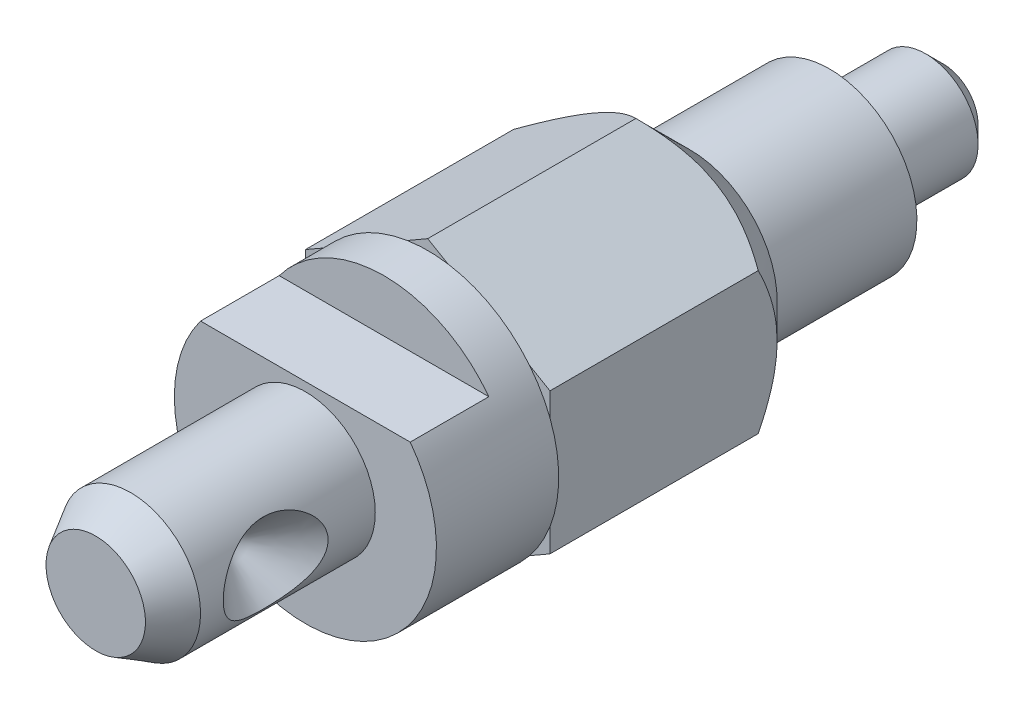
ISO-10303-21;
HEADER;
FILE_DESCRIPTION(('STEP AP214'),'2;1');
FILE_NAME('part.step','',(''),(''),'','','');
FILE_SCHEMA(('AUTOMOTIVE_DESIGN { 1 0 10303 214 1 1 1 1 }'));
ENDSEC;
DATA;
#1=APPLICATION_CONTEXT('core data for automotive mechanical design processes');
#2=APPLICATION_PROTOCOL_DEFINITION('international standard','automotive_design',2000,#1);
#3=PRODUCT_CONTEXT('',#1,'mechanical');
#4=PRODUCT('Part','Part','',(#3));
#5=PRODUCT_RELATED_PRODUCT_CATEGORY('part','',(#4));
#6=PRODUCT_DEFINITION_FORMATION('','',#4);
#7=PRODUCT_DEFINITION_CONTEXT('part definition',#1,'design');
#8=PRODUCT_DEFINITION('design','',#6,#7);
#9=PRODUCT_DEFINITION_SHAPE('','',#8);
#10=(LENGTH_UNIT() NAMED_UNIT(*) SI_UNIT(.MILLI.,.METRE.));
#11=(NAMED_UNIT(*) PLANE_ANGLE_UNIT() SI_UNIT($,.RADIAN.));
#12=(NAMED_UNIT(*) SI_UNIT($,.STERADIAN.) SOLID_ANGLE_UNIT());
#13=UNCERTAINTY_MEASURE_WITH_UNIT(LENGTH_MEASURE(1.E-05),#10,'distance_accuracy_value','');
#14=(GEOMETRIC_REPRESENTATION_CONTEXT(3) GLOBAL_UNCERTAINTY_ASSIGNED_CONTEXT((#13)) GLOBAL_UNIT_ASSIGNED_CONTEXT((#10,
#11,#12)) REPRESENTATION_CONTEXT('',''));
#15=CARTESIAN_POINT('',(0.,0.,0.));
#16=DIRECTION('',(0.,0.,1.));
#17=DIRECTION('',(1.,0.,0.));
#18=AXIS2_PLACEMENT_3D('',#15,#16,#17);
#19=CARTESIAN_POINT('',(0.,0.,42.));
#20=DIRECTION('',(0.,0.,-1.));
#21=DIRECTION('',(-1.,0.,0.));
#22=AXIS2_PLACEMENT_3D('',#19,#20,#21);
#23=PLANE('',#22);
#24=CARTESIAN_POINT('',(0.,0.,42.));
#25=DIRECTION('',(0.,0.,-1.));
#26=DIRECTION('',(-1.,0.,0.));
#27=AXIS2_PLACEMENT_3D('',#24,#25,#26);
#28=CIRCLE('',#27,2.84529946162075);
#29=CARTESIAN_POINT('',(-2.84529946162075,0.,42.));
#30=VERTEX_POINT('',#29);
#31=EDGE_CURVE('E324',#30,#30,#28,.F.);
#32=ORIENTED_EDGE('',*,*,#31,.T.);
#33=EDGE_LOOP('',(#32));
#34=FACE_BOUND('',#33,.T.);
#35=ADVANCED_FACE('F14',(#34),#23,.F.);
#36=CARTESIAN_POINT('',(0.999999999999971,0.,35.7));
#37=DIRECTION('',(1.,0.,0.));
#38=DIRECTION('',(0.,0.,-1.));
#39=AXIS2_PLACEMENT_3D('',#36,#37,#38);
#40=CONICAL_SURFACE('',#39,0.,0.785398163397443);
#41=CARTESIAN_POINT('',(3.51436275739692,-1.91030219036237,37.3348594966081));
#42=CARTESIAN_POINT('',(3.5561071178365,-1.8335136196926,37.4887949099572));
#43=CARTESIAN_POINT('',(3.60106331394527,-1.74489029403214,37.6360149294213));
#44=CARTESIAN_POINT('',(3.69207026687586,-1.54299697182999,37.9121244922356));
#45=CARTESIAN_POINT('',(3.73811880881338,-1.42977358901,38.0410479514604));
#46=CARTESIAN_POINT('',(3.80967651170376,-1.22220875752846,38.2321896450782));
#47=CARTESIAN_POINT('',(3.83670298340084,-1.13528525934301,38.3018998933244));
#48=CARTESIAN_POINT('',(3.8865014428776,-0.950886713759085,38.4275424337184));
#49=CARTESIAN_POINT('',(3.90928026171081,-0.853429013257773,38.483496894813));
#50=CARTESIAN_POINT('',(3.94509187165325,-0.666155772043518,38.5702517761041));
#51=CARTESIAN_POINT('',(3.95911502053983,-0.577759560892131,38.6036865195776));
#52=CARTESIAN_POINT('',(3.98138499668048,-0.396129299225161,38.6564398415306));
#53=CARTESIAN_POINT('',(3.98963574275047,-0.302898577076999,38.6757679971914));
#54=CARTESIAN_POINT('',(3.99950772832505,-0.113738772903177,38.6988661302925));
#55=CARTESIAN_POINT('',(4.00110049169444,-0.017799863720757,38.702569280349));
#56=CARTESIAN_POINT('',(3.99738984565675,0.173210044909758,38.6939075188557));
#57=CARTESIAN_POINT('',(3.9920859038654,0.268280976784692,38.6815413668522));
#58=CARTESIAN_POINT('',(3.97574780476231,0.448420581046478,38.6431033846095));
#59=CARTESIAN_POINT('',(3.96511435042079,0.533735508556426,38.6179885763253));
#60=CARTESIAN_POINT('',(3.93928956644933,0.699308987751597,38.5562288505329));
#61=CARTESIAN_POINT('',(3.92409640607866,0.779565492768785,38.5195793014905));
#62=CARTESIAN_POINT('',(3.88302448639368,0.96685655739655,38.4188316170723));
#63=CARTESIAN_POINT('',(3.85534818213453,1.07078346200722,38.3496869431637));
#64=CARTESIAN_POINT('',(3.79594567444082,1.26538916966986,38.1961288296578));
#65=CARTESIAN_POINT('',(3.76420999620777,1.35603587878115,38.1116794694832));
#66=CARTESIAN_POINT('',(3.68792748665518,1.55371609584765,37.8992745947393));
#67=CARTESIAN_POINT('',(3.64280030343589,1.65530122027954,37.7664635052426));
#68=CARTESIAN_POINT('',(3.55543603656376,1.83545709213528,37.4853240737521));
#69=CARTESIAN_POINT('',(3.5132017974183,1.91400543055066,37.3369808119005));
#70=CARTESIAN_POINT('',(3.43558984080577,2.05012091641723,37.0254924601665));
#71=CARTESIAN_POINT('',(3.40036396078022,2.1072431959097,36.8621129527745));
#72=CARTESIAN_POINT('',(3.35684110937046,2.17539024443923,36.6108871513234));
#73=CARTESIAN_POINT('',(3.3438854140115,2.1951841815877,36.5261112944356));
#74=CARTESIAN_POINT('',(3.32151551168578,2.22888978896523,36.3549475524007));
#75=CARTESIAN_POINT('',(3.31210004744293,2.24280354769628,36.2685602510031));
#76=CARTESIAN_POINT('',(3.29664304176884,2.26546838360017,36.0885370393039));
#77=CARTESIAN_POINT('',(3.29088791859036,2.27378367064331,35.9948213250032));
#78=CARTESIAN_POINT('',(3.28411640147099,2.28355307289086,35.8068580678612));
#79=CARTESIAN_POINT('',(3.28310020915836,2.28500689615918,35.7126105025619));
#80=CARTESIAN_POINT('',(3.28585787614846,2.28104059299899,35.524330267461));
#81=CARTESIAN_POINT('',(3.28963149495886,2.27562081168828,35.4302975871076));
#82=CARTESIAN_POINT('',(3.30178158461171,2.2579510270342,35.2432036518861));
#83=CARTESIAN_POINT('',(3.31015795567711,2.24570117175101,35.1501423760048));
#84=CARTESIAN_POINT('',(3.3407114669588,2.20022874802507,34.8818881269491));
#85=CARTESIAN_POINT('',(3.36851525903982,2.15806110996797,34.7087480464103));
#86=CARTESIAN_POINT('',(3.4356681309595,2.04944268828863,34.3723965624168));
#87=CARTESIAN_POINT('',(3.47503836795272,1.98294734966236,34.2092040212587));
#88=CARTESIAN_POINT('',(3.56265529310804,1.8211159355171,33.8881374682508));
#89=CARTESIAN_POINT('',(3.61127385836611,1.72438161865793,33.7310639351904));
#90=CARTESIAN_POINT('',(3.70908700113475,1.50243062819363,33.4388151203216));
#91=CARTESIAN_POINT('',(3.75827915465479,1.37730879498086,33.3035694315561));
#92=CARTESIAN_POINT('',(3.83033247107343,1.15581813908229,33.1143283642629));
#93=CARTESIAN_POINT('',(3.85564047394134,1.0691094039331,33.0499247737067));
#94=CARTESIAN_POINT('',(3.90178575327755,0.885970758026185,32.9347618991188));
#95=CARTESIAN_POINT('',(3.92263012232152,0.789556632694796,32.8839809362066));
#96=CARTESIAN_POINT('',(3.95514985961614,0.603576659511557,32.8057002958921));
#97=CARTESIAN_POINT('',(3.96773369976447,0.515169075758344,32.775845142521));
#98=CARTESIAN_POINT('',(3.98705476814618,0.334148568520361,32.7302456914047));
#99=CARTESIAN_POINT('',(3.99379552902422,0.241538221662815,32.7144928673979));
#100=CARTESIAN_POINT('',(4.0007284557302,0.0544116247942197,32.6982931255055));
#101=CARTESIAN_POINT('',(4.00089901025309,-0.0401098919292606,32.6978967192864));
#102=CARTESIAN_POINT('',(3.99461662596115,-0.227714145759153,32.7125725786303));
#103=CARTESIAN_POINT('',(3.98816242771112,-0.320796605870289,32.7276477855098));
#104=CARTESIAN_POINT('',(3.96978699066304,-0.49838519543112,32.7709861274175));
#105=CARTESIAN_POINT('',(3.95814514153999,-0.583088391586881,32.7985764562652));
#106=CARTESIAN_POINT('',(3.93048356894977,-0.747151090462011,32.8650125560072));
#107=CARTESIAN_POINT('',(3.91446203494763,-0.826508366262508,32.903862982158));
#108=CARTESIAN_POINT('',(3.87105954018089,-1.0138531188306,33.0109870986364));
#109=CARTESIAN_POINT('',(3.84183228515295,-1.11836586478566,33.0845954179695));
#110=CARTESIAN_POINT('',(3.77960819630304,-1.31343290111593,33.2471752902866));
#111=CARTESIAN_POINT('',(3.74660220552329,-1.40395197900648,33.3361844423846));
#112=CARTESIAN_POINT('',(3.66808686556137,-1.59993691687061,33.5585674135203));
#113=CARTESIAN_POINT('',(3.62217607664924,-1.69986103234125,33.6966797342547));
#114=CARTESIAN_POINT('',(3.53418598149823,-1.87595804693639,33.9882714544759));
#115=CARTESIAN_POINT('',(3.49210989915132,-1.95211108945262,34.1417635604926));
#116=CARTESIAN_POINT('',(3.41606220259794,-2.08238524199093,34.4630624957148));
#117=CARTESIAN_POINT('',(3.38224182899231,-2.13610643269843,34.6310695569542));
#118=CARTESIAN_POINT('',(3.34173076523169,-2.1985052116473,34.8888660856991));
#119=CARTESIAN_POINT('',(3.32992976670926,-2.21627502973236,34.9757701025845));
#120=CARTESIAN_POINT('',(3.31015224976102,-2.24571004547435,35.1510251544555));
#121=CARTESIAN_POINT('',(3.30217429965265,-2.25737752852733,35.2393756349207));
#122=CARTESIAN_POINT('',(3.29008633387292,-2.27496182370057,35.4211814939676));
#123=CARTESIAN_POINT('',(3.28617875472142,-2.2805781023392,35.514679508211));
#124=CARTESIAN_POINT('',(3.28309570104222,-2.28501420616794,35.7019194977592));
#125=CARTESIAN_POINT('',(3.28392047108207,-2.28383368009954,35.7956614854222));
#126=CARTESIAN_POINT('',(3.29026632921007,-2.27468229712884,35.9826465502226));
#127=CARTESIAN_POINT('',(3.29578693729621,-2.26671213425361,36.0758896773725));
#128=CARTESIAN_POINT('',(3.31126432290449,-2.24403876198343,36.2611522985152));
#129=CARTESIAN_POINT('',(3.32122074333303,-2.22933609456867,36.3531718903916));
#130=CARTESIAN_POINT('',(3.3536426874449,-2.18047848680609,36.5999234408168));
#131=CARTESIAN_POINT('',(3.37997406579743,-2.13992107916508,36.7529383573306));
#132=CARTESIAN_POINT('',(3.44144194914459,-2.03958648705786,37.0507606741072));
#133=CARTESIAN_POINT('',(3.47658728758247,-1.979790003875,37.1955596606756));
#134=CARTESIAN_POINT('',(3.51436275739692,-1.91030219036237,37.3348594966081));
#135=B_SPLINE_CURVE_WITH_KNOTS('',3,(#41,#42,#43,#44,#45,#46,#47,#48,#49,#50,#51,#52,#53,#54,
#55,#56,#57,#58,#59,#60,#61,#62,#63,#64,#65,#66,#67,#68,#69,#70,#71,#72,#73,#74,#75,#76,#77,#78,
#79,#80,#81,#82,#83,#84,#85,#86,#87,#88,#89,#90,#91,#92,#93,#94,#95,#96,#97,#98,#99,#100,#101,
#102,#103,#104,#105,#106,#107,#108,#109,#110,#111,#112,#113,#114,#115,#116,#117,#118,#119,#120,
#121,#122,#123,#124,#125,#126,#127,#128,#129,#130,#131,#132,#133,#134),.UNSPECIFIED.,.T.,.F.,(4,
2,2,2,2,2,2,2,2,2,2,2,2,2,2,2,2,2,2,2,2,2,2,2,2,2,2,2,2,2,2,2,2,2,2,2,2,2,2,2,2,2,2,2,2,2,4),
(0.,0.530571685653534,1.06014664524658,1.40300195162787,1.74530103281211,2.0307454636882,
2.31599592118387,2.60246515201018,2.88895649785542,3.15656593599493,3.42428296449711,
3.80572800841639,4.18808019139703,4.70489972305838,5.22222033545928,5.74975482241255,
6.01356911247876,6.27728962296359,6.55970104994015,6.84212449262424,7.12453375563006,
7.4069368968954,7.94544572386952,8.48494578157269,9.05444851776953,9.62207590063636,
9.95380959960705,10.2850122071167,10.5662923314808,10.8474022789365,11.1294367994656,
11.4115249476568,11.6799755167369,11.9485372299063,12.3397401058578,12.7319118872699,
13.2587566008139,13.786040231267,14.3223597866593,14.5905644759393,14.8586686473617,
15.1395488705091,15.4204436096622,15.7013096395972,15.9821530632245,16.4617974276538,
16.9419244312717),.UNSPECIFIED.);
#136=CARTESIAN_POINT('',(3.51436275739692,-1.91030219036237,37.3348594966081));
#137=VERTEX_POINT('',#136);
#138=EDGE_CURVE('E334',#137,#137,#135,.T.);
#139=ORIENTED_EDGE('',*,*,#138,.F.);
#140=EDGE_LOOP('',(#139));
#141=FACE_BOUND('',#140,.T.);
#142=CARTESIAN_POINT('',(0.999999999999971,0.,35.7));
#143=VERTEX_POINT('',#142);
#144=VERTEX_LOOP('',#143);
#145=FACE_BOUND('',#144,.T.);
#146=ADVANCED_FACE('F118',(#141,#145),#40,.F.);
#147=CARTESIAN_POINT('',(0.,0.,42.));
#148=DIRECTION('',(0.,0.,-1.));
#149=DIRECTION('',(-1.,0.,0.));
#150=AXIS2_PLACEMENT_3D('',#147,#148,#149);
#151=CONICAL_SURFACE('',#150,2.84529946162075,0.523598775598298);
#152=CARTESIAN_POINT('',(0.,0.,40.));
#153=DIRECTION('',(0.,0.,-1.));
#154=DIRECTION('',(-1.,0.,0.));
#155=AXIS2_PLACEMENT_3D('',#152,#153,#154);
#156=CIRCLE('',#155,4.);
#157=CARTESIAN_POINT('',(-4.,0.,40.));
#158=VERTEX_POINT('',#157);
#159=EDGE_CURVE('E328',#158,#158,#156,.T.);
#160=ORIENTED_EDGE('',*,*,#159,.F.);
#161=EDGE_LOOP('',(#160));
#162=FACE_BOUND('',#161,.T.);
#163=ORIENTED_EDGE('',*,*,#31,.F.);
#164=EDGE_LOOP('',(#163));
#165=FACE_BOUND('',#164,.T.);
#166=ADVANCED_FACE('F120',(#162,#165),#151,.T.);
#167=CARTESIAN_POINT('',(0.,0.,30.));
#168=DIRECTION('',(0.,0.,1.));
#169=DIRECTION('',(1.,0.,0.));
#170=AXIS2_PLACEMENT_3D('',#167,#168,#169);
#171=CYLINDRICAL_SURFACE('',#170,4.);
#172=ORIENTED_EDGE('',*,*,#159,.T.);
#173=EDGE_LOOP('',(#172));
#174=FACE_BOUND('',#173,.T.);
#175=CARTESIAN_POINT('',(0.,0.,30.));
#176=DIRECTION('',(0.,0.,1.));
#177=DIRECTION('',(1.,0.,0.));
#178=AXIS2_PLACEMENT_3D('',#175,#176,#177);
#179=CIRCLE('',#178,4.);
#180=CARTESIAN_POINT('',(4.,0.,30.));
#181=VERTEX_POINT('',#180);
#182=EDGE_CURVE('E303',#181,#181,#179,.T.);
#183=ORIENTED_EDGE('',*,*,#182,.T.);
#184=EDGE_LOOP('',(#183));
#185=FACE_BOUND('',#184,.T.);
#186=ORIENTED_EDGE('',*,*,#138,.T.);
#187=EDGE_LOOP('',(#186));
#188=FACE_BOUND('',#187,.T.);
#189=ADVANCED_FACE('F130',(#174,#185,#188),#171,.T.);
#190=CARTESIAN_POINT('',(0.,0.,30.));
#191=DIRECTION('',(0.,0.,1.));
#192=DIRECTION('',(1.,0.,0.));
#193=AXIS2_PLACEMENT_3D('',#190,#191,#192);
#194=PLANE('',#193);
#195=DIRECTION('',(1.,0.,0.));
#196=VECTOR('',#195,1.);
#197=CARTESIAN_POINT('',(0.,4.5,30.));
#198=LINE('',#197,#196);
#199=CARTESIAN_POINT('',(-6.,4.5,30.));
#200=VERTEX_POINT('',#199);
#201=CARTESIAN_POINT('',(6.,4.5,30.));
#202=VERTEX_POINT('',#201);
#203=EDGE_CURVE('E325',#200,#202,#198,.T.);
#204=ORIENTED_EDGE('',*,*,#203,.F.);
#205=CARTESIAN_POINT('',(0.,0.,30.));
#206=DIRECTION('',(0.,0.,1.));
#207=DIRECTION('',(1.,0.,0.));
#208=AXIS2_PLACEMENT_3D('',#205,#206,#207);
#209=CIRCLE('',#208,7.5);
#210=EDGE_CURVE('E296',#200,#202,#209,.T.);
#211=ORIENTED_EDGE('',*,*,#210,.T.);
#212=EDGE_LOOP('',(#204,#211));
#213=FACE_BOUND('',#212,.T.);
#214=ORIENTED_EDGE('',*,*,#182,.F.);
#215=EDGE_LOOP('',(#214));
#216=FACE_BOUND('',#215,.T.);
#217=ADVANCED_FACE('F136',(#213,#216),#194,.T.);
#218=CARTESIAN_POINT('',(19.5,4.5,25.5));
#219=DIRECTION('',(0.,-1.,0.));
#220=DIRECTION('',(0.,0.,1.));
#221=AXIS2_PLACEMENT_3D('',#218,#219,#220);
#222=PLANE('',#221);
#223=DIRECTION('',(-1.,0.,0.));
#224=VECTOR('',#223,1.);
#225=CARTESIAN_POINT('',(19.5,4.5,25.5));
#226=LINE('',#225,#224);
#227=CARTESIAN_POINT('',(6.,4.5,25.5));
#228=VERTEX_POINT('',#227);
#229=CARTESIAN_POINT('',(-6.,4.5,25.5));
#230=VERTEX_POINT('',#229);
#231=EDGE_CURVE('E316',#228,#230,#226,.T.);
#232=ORIENTED_EDGE('',*,*,#231,.T.);
#233=DIRECTION('',(0.,0.,1.));
#234=VECTOR('',#233,1.);
#235=CARTESIAN_POINT('',(-6.,4.5,23.));
#236=LINE('',#235,#234);
#237=EDGE_CURVE('E313',#200,#230,#236,.F.);
#238=ORIENTED_EDGE('',*,*,#237,.F.);
#239=ORIENTED_EDGE('',*,*,#203,.T.);
#240=DIRECTION('',(0.,0.,1.));
#241=VECTOR('',#240,1.);
#242=CARTESIAN_POINT('',(6.,4.5,23.));
#243=LINE('',#242,#241);
#244=EDGE_CURVE('E308',#228,#202,#243,.T.);
#245=ORIENTED_EDGE('',*,*,#244,.F.);
#246=EDGE_LOOP('',(#232,#238,#239,#245));
#247=FACE_BOUND('',#246,.T.);
#248=ADVANCED_FACE('F133',(#247),#222,.F.);
#249=CARTESIAN_POINT('',(19.5,9.49790295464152,25.5));
#250=DIRECTION('',(0.,0.,-1.));
#251=DIRECTION('',(0.,-1.,0.));
#252=AXIS2_PLACEMENT_3D('',#249,#250,#251);
#253=PLANE('',#252);
#254=ORIENTED_EDGE('',*,*,#231,.F.);
#255=CARTESIAN_POINT('',(0.,0.,25.5));
#256=DIRECTION('',(0.,0.,-1.));
#257=DIRECTION('',(0.,-1.,0.));
#258=AXIS2_PLACEMENT_3D('',#255,#256,#257);
#259=CIRCLE('',#258,7.5);
#260=EDGE_CURVE('E323',#230,#228,#259,.T.);
#261=ORIENTED_EDGE('',*,*,#260,.F.);
#262=EDGE_LOOP('',(#254,#261));
#263=FACE_BOUND('',#262,.T.);
#264=ADVANCED_FACE('F137',(#263),#253,.F.);
#265=CARTESIAN_POINT('',(0.,0.,23.));
#266=DIRECTION('',(0.,0.,-1.));
#267=DIRECTION('',(-1.,0.,0.));
#268=AXIS2_PLACEMENT_3D('',#265,#266,#267);
#269=PLANE('',#268);
#270=DIRECTION('',(-0.866025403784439,-0.5,0.));
#271=VECTOR('',#270,1.);
#272=CARTESIAN_POINT('',(0.,8.08290376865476,23.));
#273=LINE('',#272,#271);
#274=CARTESIAN_POINT('',(-1.1681552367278,7.4084690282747,23.));
#275=VERTEX_POINT('',#274);
#276=CARTESIAN_POINT('',(-5.83184476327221,4.71588662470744,23.));
#277=VERTEX_POINT('',#276);
#278=EDGE_CURVE('E384',#275,#277,#273,.T.);
#279=ORIENTED_EDGE('',*,*,#278,.T.);
#280=CARTESIAN_POINT('',(0.,0.,23.));
#281=DIRECTION('',(0.,0.,-1.));
#282=DIRECTION('',(-1.,0.,0.));
#283=AXIS2_PLACEMENT_3D('',#280,#281,#282);
#284=CIRCLE('',#283,7.5);
#285=EDGE_CURVE('E330',#277,#275,#284,.T.);
#286=ORIENTED_EDGE('',*,*,#285,.T.);
#287=EDGE_LOOP('',(#279,#286));
#288=FACE_BOUND('',#287,.T.);
#289=ADVANCED_FACE('F557',(#288),#269,.T.);
#290=DIRECTION('',(-0.866025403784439,0.5,0.));
#291=VECTOR('',#290,1.);
#292=CARTESIAN_POINT('',(7.,4.04145188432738,23.));
#293=LINE('',#292,#291);
#294=CARTESIAN_POINT('',(5.8318447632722,4.71588662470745,23.));
#295=VERTEX_POINT('',#294);
#296=CARTESIAN_POINT('',(1.16815523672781,7.40846902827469,23.));
#297=VERTEX_POINT('',#296);
#298=EDGE_CURVE('E388',#295,#297,#293,.T.);
#299=ORIENTED_EDGE('',*,*,#298,.T.);
#300=EDGE_CURVE('E416',#297,#295,#284,.T.);
#301=ORIENTED_EDGE('',*,*,#300,.T.);
#302=EDGE_LOOP('',(#299,#301));
#303=FACE_BOUND('',#302,.T.);
#304=ADVANCED_FACE('F359',(#303),#269,.T.);
#305=DIRECTION('',(0.,1.,0.));
#306=VECTOR('',#305,1.);
#307=CARTESIAN_POINT('',(7.,-4.04145188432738,23.));
#308=LINE('',#307,#306);
#309=CARTESIAN_POINT('',(7.,-2.69258240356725,23.));
#310=VERTEX_POINT('',#309);
#311=CARTESIAN_POINT('',(7.,2.69258240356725,23.));
#312=VERTEX_POINT('',#311);
#313=EDGE_CURVE('E396',#310,#312,#308,.T.);
#314=ORIENTED_EDGE('',*,*,#313,.T.);
#315=EDGE_CURVE('E369',#312,#310,#284,.T.);
#316=ORIENTED_EDGE('',*,*,#315,.T.);
#317=EDGE_LOOP('',(#314,#316));
#318=FACE_BOUND('',#317,.T.);
#319=ADVANCED_FACE('F346',(#318),#269,.T.);
#320=DIRECTION('',(0.866025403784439,0.5,0.));
#321=VECTOR('',#320,1.);
#322=CARTESIAN_POINT('',(0.,-8.08290376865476,23.));
#323=LINE('',#322,#321);
#324=CARTESIAN_POINT('',(1.16815523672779,-7.4084690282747,23.));
#325=VERTEX_POINT('',#324);
#326=CARTESIAN_POINT('',(5.83184476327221,-4.71588662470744,23.));
#327=VERTEX_POINT('',#326);
#328=EDGE_CURVE('E36',#325,#327,#323,.T.);
#329=ORIENTED_EDGE('',*,*,#328,.T.);
#330=EDGE_CURVE('E301',#327,#325,#284,.T.);
#331=ORIENTED_EDGE('',*,*,#330,.T.);
#332=EDGE_LOOP('',(#329,#331));
#333=FACE_BOUND('',#332,.T.);
#334=ADVANCED_FACE('F166',(#333),#269,.T.);
#335=DIRECTION('',(0.866025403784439,-0.5,0.));
#336=VECTOR('',#335,1.);
#337=CARTESIAN_POINT('',(-7.,-4.04145188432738,23.));
#338=LINE('',#337,#336);
#339=CARTESIAN_POINT('',(-5.8318447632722,-4.71588662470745,23.));
#340=VERTEX_POINT('',#339);
#341=CARTESIAN_POINT('',(-1.1681552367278,-7.40846902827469,23.));
#342=VERTEX_POINT('',#341);
#343=EDGE_CURVE('E372',#340,#342,#338,.T.);
#344=ORIENTED_EDGE('',*,*,#343,.T.);
#345=EDGE_CURVE('E295',#342,#340,#284,.T.);
#346=ORIENTED_EDGE('',*,*,#345,.T.);
#347=EDGE_LOOP('',(#344,#346));
#348=FACE_BOUND('',#347,.T.);
#349=ADVANCED_FACE('F350',(#348),#269,.T.);
#350=DIRECTION('',(0.,-1.,0.));
#351=VECTOR('',#350,1.);
#352=CARTESIAN_POINT('',(-7.,4.04145188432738,23.));
#353=LINE('',#352,#351);
#354=CARTESIAN_POINT('',(-7.,2.69258240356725,23.));
#355=VERTEX_POINT('',#354);
#356=CARTESIAN_POINT('',(-7.,-2.69258240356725,23.));
#357=VERTEX_POINT('',#356);
#358=EDGE_CURVE('E378',#355,#357,#353,.T.);
#359=ORIENTED_EDGE('',*,*,#358,.T.);
#360=EDGE_CURVE('E287',#357,#355,#284,.T.);
#361=ORIENTED_EDGE('',*,*,#360,.T.);
#362=EDGE_LOOP('',(#359,#361));
#363=FACE_BOUND('',#362,.T.);
#364=ADVANCED_FACE('F357',(#363),#269,.T.);
#365=CARTESIAN_POINT('',(0.,0.,23.));
#366=DIRECTION('',(0.,0.,1.));
#367=DIRECTION('',(1.,0.,0.));
#368=AXIS2_PLACEMENT_3D('',#365,#366,#367);
#369=CYLINDRICAL_SURFACE('',#368,7.5);
#370=EDGE_CURVE('E291',#355,#277,#284,.T.);
#371=ORIENTED_EDGE('',*,*,#370,.F.);
#372=ORIENTED_EDGE('',*,*,#360,.F.);
#373=EDGE_CURVE('E284',#340,#357,#284,.T.);
#374=ORIENTED_EDGE('',*,*,#373,.F.);
#375=ORIENTED_EDGE('',*,*,#345,.F.);
#376=EDGE_CURVE('E285',#325,#342,#284,.T.);
#377=ORIENTED_EDGE('',*,*,#376,.F.);
#378=ORIENTED_EDGE('',*,*,#330,.F.);
#379=EDGE_CURVE('E29',#310,#327,#284,.T.);
#380=ORIENTED_EDGE('',*,*,#379,.F.);
#381=ORIENTED_EDGE('',*,*,#315,.F.);
#382=EDGE_CURVE('E401',#295,#312,#284,.T.);
#383=ORIENTED_EDGE('',*,*,#382,.F.);
#384=ORIENTED_EDGE('',*,*,#300,.F.);
#385=EDGE_CURVE('E410',#275,#297,#284,.T.);
#386=ORIENTED_EDGE('',*,*,#385,.F.);
#387=ORIENTED_EDGE('',*,*,#285,.F.);
#388=EDGE_LOOP('',(#371,#372,#374,#375,#377,#378,#380,#381,#383,#384,#386,#387));
#389=FACE_BOUND('',#388,.T.);
#390=ORIENTED_EDGE('',*,*,#260,.T.);
#391=ORIENTED_EDGE('',*,*,#244,.T.);
#392=ORIENTED_EDGE('',*,*,#210,.F.);
#393=ORIENTED_EDGE('',*,*,#237,.T.);
#394=EDGE_LOOP('',(#390,#391,#392,#393));
#395=FACE_BOUND('',#394,.T.);
#396=ADVANCED_FACE('F164',(#389,#395),#369,.T.);
#397=CARTESIAN_POINT('',(0.,0.,0.));
#398=DIRECTION('',(0.,0.,1.));
#399=DIRECTION('',(0.5,-0.866025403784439,0.));
#400=AXIS2_PLACEMENT_3D('',#397,#398,#399);
#401=PLANE('',#400);
#402=CARTESIAN_POINT('',(0.,0.,0.));
#403=DIRECTION('',(0.,0.,1.));
#404=DIRECTION('',(1.,0.,0.));
#405=AXIS2_PLACEMENT_3D('',#402,#403,#404);
#406=CIRCLE('',#405,3.);
#407=CARTESIAN_POINT('',(3.,0.,0.));
#408=VERTEX_POINT('',#407);
#409=EDGE_CURVE('E419',#408,#408,#406,.F.);
#410=ORIENTED_EDGE('',*,*,#409,.F.);
#411=EDGE_LOOP('',(#410));
#412=FACE_BOUND('',#411,.T.);
#413=CARTESIAN_POINT('',(0.,0.,0.));
#414=DIRECTION('',(0.,0.,1.));
#415=DIRECTION('',(0.5,-0.866025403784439,0.));
#416=AXIS2_PLACEMENT_3D('',#413,#414,#415);
#417=CIRCLE('',#416,5.);
#418=CARTESIAN_POINT('',(2.5,-4.3301270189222,0.));
#419=VERTEX_POINT('',#418);
#420=EDGE_CURVE('E281',#419,#419,#417,.T.);
#421=ORIENTED_EDGE('',*,*,#420,.F.);
#422=EDGE_LOOP('',(#421));
#423=FACE_BOUND('',#422,.T.);
#424=ADVANCED_FACE('F160',(#412,#423),#401,.F.);
#425=CARTESIAN_POINT('',(0.,0.,10.));
#426=DIRECTION('',(0.,0.,-1.));
#427=DIRECTION('',(-0.5,0.866025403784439,0.));
#428=AXIS2_PLACEMENT_3D('',#425,#426,#427);
#429=CYLINDRICAL_SURFACE('',#428,5.);
#430=ORIENTED_EDGE('',*,*,#420,.T.);
#431=EDGE_LOOP('',(#430));
#432=FACE_BOUND('',#431,.T.);
#433=CARTESIAN_POINT('',(0.,0.,8.));
#434=DIRECTION('',(0.,0.,-1.));
#435=DIRECTION('',(-0.5,0.866025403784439,0.));
#436=AXIS2_PLACEMENT_3D('',#433,#434,#435);
#437=CIRCLE('',#436,5.);
#438=CARTESIAN_POINT('',(-2.5,4.3301270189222,8.));
#439=VERTEX_POINT('',#438);
#440=EDGE_CURVE('E340',#439,#439,#437,.T.);
#441=ORIENTED_EDGE('',*,*,#440,.T.);
#442=EDGE_LOOP('',(#441));
#443=FACE_BOUND('',#442,.T.);
#444=ADVANCED_FACE('F156',(#432,#443),#429,.T.);
#445=CARTESIAN_POINT('',(0.,0.,11.0829037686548));
#446=DIRECTION('',(0.,0.,1.));
#447=DIRECTION('',(0.5,-0.866025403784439,0.));
#448=AXIS2_PLACEMENT_3D('',#445,#446,#447);
#449=CONICAL_SURFACE('',#448,8.08290376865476,0.785398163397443);
#450=ORIENTED_EDGE('',*,*,#440,.F.);
#451=EDGE_LOOP('',(#450));
#452=FACE_BOUND('',#451,.T.);
#453=CARTESIAN_POINT('',(-3.12318920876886,-9.88607789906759,13.3676828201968));
#454=CARTESIAN_POINT('',(-2.96021190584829,-9.7919829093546,13.2288949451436));
#455=CARTESIAN_POINT('',(-2.79628352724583,-9.69733881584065,13.091571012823));
#456=CARTESIAN_POINT('',(-2.46616540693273,-9.50674503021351,12.8204907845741));
#457=CARTESIAN_POINT('',(-2.29997506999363,-9.41079499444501,12.686735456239));
#458=CARTESIAN_POINT('',(-1.96376274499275,-9.21668271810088,12.4224870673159));
#459=CARTESIAN_POINT('',(-1.79372104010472,-9.11850909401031,12.2920273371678));
#460=CARTESIAN_POINT('',(-1.45069580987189,-8.92046338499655,12.0363869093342));
#461=CARTESIAN_POINT('',(-1.27771250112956,-8.82059142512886,11.9112058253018));
#462=CARTESIAN_POINT('',(-0.919567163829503,-8.61381611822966,11.6611172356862));
#463=CARTESIAN_POINT('',(-0.734230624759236,-8.50681201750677,11.536541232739));
#464=CARTESIAN_POINT('',(-0.359277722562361,-8.29033285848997,11.296160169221));
#465=CARTESIAN_POINT('',(-0.169660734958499,-8.18085743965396,11.1803563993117));
#466=CARTESIAN_POINT('',(0.213756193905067,-7.95949157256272,10.9600528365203));
#467=CARTESIAN_POINT('',(0.407541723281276,-7.84760944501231,10.8555198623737));
#468=CARTESIAN_POINT('',(0.800161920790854,-7.62093006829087,10.6600936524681));
#469=CARTESIAN_POINT('',(0.998994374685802,-7.50613409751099,10.5691945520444));
#470=CARTESIAN_POINT('',(1.3902833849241,-7.28022328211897,10.4089512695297));
#471=CARTESIAN_POINT('',(1.58244825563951,-7.16927684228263,10.3386676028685));
#472=CARTESIAN_POINT('',(1.97109122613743,-6.944893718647,10.2159692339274));
#473=CARTESIAN_POINT('',(2.16756965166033,-6.8314568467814,10.1635558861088));
#474=CARTESIAN_POINT('',(2.56056321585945,-6.60456190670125,10.0801032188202));
#475=CARTESIAN_POINT('',(2.75702297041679,-6.49113581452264,10.0487216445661));
#476=CARTESIAN_POINT('',(3.15165186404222,-6.263296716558,10.0078777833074));
#477=CARTESIAN_POINT('',(3.34982076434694,-6.14888384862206,9.99841248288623));
#478=CARTESIAN_POINT('',(3.74026236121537,-5.92346228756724,10.0019724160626));
#479=CARTESIAN_POINT('',(3.93253975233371,-5.81245088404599,10.0143548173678));
#480=CARTESIAN_POINT('',(4.31526794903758,-5.59148265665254,10.059593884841));
#481=CARTESIAN_POINT('',(4.50571856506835,-5.48152594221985,10.0924526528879));
#482=CARTESIAN_POINT('',(4.88663127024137,-5.26160588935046,10.1774843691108));
#483=CARTESIAN_POINT('',(5.07703978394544,-5.15167348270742,10.2299725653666));
#484=CARTESIAN_POINT('',(5.45374514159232,-4.93418254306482,10.3515884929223));
#485=CARTESIAN_POINT('',(5.64004244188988,-4.82662374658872,10.4207143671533));
#486=CARTESIAN_POINT('',(6.03414803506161,-4.59908677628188,10.5836168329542));
#487=CARTESIAN_POINT('',(6.2412999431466,-4.47948756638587,10.6794924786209));
#488=CARTESIAN_POINT('',(6.65013734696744,-4.24344518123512,10.8858122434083));
#489=CARTESIAN_POINT('',(6.85182012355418,-4.12700357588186,10.9962634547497));
#490=CARTESIAN_POINT('',(7.25075556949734,-3.89667808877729,11.2290904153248));
#491=CARTESIAN_POINT('',(7.44799130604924,-3.78280398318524,11.3515045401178));
#492=CARTESIAN_POINT('',(7.83789367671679,-3.55769374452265,11.6055349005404));
#493=CARTESIAN_POINT('',(8.03056106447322,-3.44645717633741,11.7371496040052));
#494=CARTESIAN_POINT('',(8.40231847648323,-3.2318229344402,12.0009133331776));
#495=CARTESIAN_POINT('',(8.58160266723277,-3.12831315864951,12.1326993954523));
#496=CARTESIAN_POINT('',(8.93709823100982,-2.92306769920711,12.4017035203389));
#497=CARTESIAN_POINT('',(9.11330936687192,-2.82133215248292,12.5389219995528));
#498=CARTESIAN_POINT('',(9.46161600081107,-2.62023722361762,12.816659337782));
#499=CARTESIAN_POINT('',(9.6337334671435,-2.52086515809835,12.9571415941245));
#500=CARTESIAN_POINT('',(9.97563178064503,-2.32347007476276,13.2417392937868));
#501=CARTESIAN_POINT('',(10.1454132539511,-2.22544669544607,13.3858537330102));
#502=CARTESIAN_POINT('',(10.3142192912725,-2.12798648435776,13.5314503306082));
#503=B_SPLINE_CURVE_WITH_KNOTS('',3,(#453,#454,#455,#456,#457,#458,#459,#460,#461,#462,#463,
#464,#465,#466,#467,#468,#469,#470,#471,#472,#473,#474,#475,#476,#477,#478,#479,#480,#481,#482,
#483,#484,#485,#486,#487,#488,#489,#490,#491,#492,#493,#494,#495,#496,#497,#498,#499,#500,#501,
#502),.UNSPECIFIED.,.F.,.F.,(4,2,2,2,2,2,2,2,2,2,2,2,2,2,2,2,2,2,2,2,2,2,2,2,4),(0.,
0.701511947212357,1.40321220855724,2.1103525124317,2.81744097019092,3.56015211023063,
4.30297231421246,5.04354223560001,5.7837926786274,6.48143790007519,7.17913598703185,
7.8651851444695,8.55113996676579,9.21724689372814,9.88342220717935,10.5607908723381,
11.2380839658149,12.0105614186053,12.783416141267,13.5588369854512,14.3341290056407,
15.0702502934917,15.8064281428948,16.5365278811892,17.26642795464),.UNSPECIFIED.);
#504=CARTESIAN_POINT('',(0.,-8.08290376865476,11.0829037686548));
#505=VERTEX_POINT('',#504);
#506=CARTESIAN_POINT('',(7.,-4.04145188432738,11.0829037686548));
#507=VERTEX_POINT('',#506);
#508=EDGE_CURVE('E203',#505,#507,#503,.T.);
#509=ORIENTED_EDGE('',*,*,#508,.F.);
#510=CARTESIAN_POINT('',(-7.0002,-4.04133641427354,11.083019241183));
#511=CARTESIAN_POINT('',(-6.87984053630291,-4.11082598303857,11.0135371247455));
#512=CARTESIAN_POINT('',(-6.75855593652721,-4.18084967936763,10.9461873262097));
#513=CARTESIAN_POINT('',(-6.51395497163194,-4.32207011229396,10.816401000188));
#514=CARTESIAN_POINT('',(-6.3906375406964,-4.39326746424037,10.7539671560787));
#515=CARTESIAN_POINT('',(-6.01621815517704,-4.60943859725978,10.5744801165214));
#516=CARTESIAN_POINT('',(-5.76194658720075,-4.75624235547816,10.4660070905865));
#517=CARTESIAN_POINT('',(-5.24918766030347,-5.05228385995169,10.2802545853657));
#518=CARTESIAN_POINT('',(-4.99083135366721,-5.20144594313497,10.2025071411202));
#519=CARTESIAN_POINT('',(-4.59904950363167,-5.4276412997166,10.1125725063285));
#520=CARTESIAN_POINT('',(-4.46787875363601,-5.5033727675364,10.0870540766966));
#521=CARTESIAN_POINT('',(-4.20442664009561,-5.65547691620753,10.0454901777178));
#522=CARTESIAN_POINT('',(-4.07214544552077,-5.73184949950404,10.0294432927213));
#523=CARTESIAN_POINT('',(-3.74979301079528,-5.91795976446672,10.0025383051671));
#524=CARTESIAN_POINT('',(-3.55937444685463,-6.02789797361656,9.99689322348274));
#525=CARTESIAN_POINT('',(-3.17888053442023,-6.24757623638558,10.0063687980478));
#526=CARTESIAN_POINT('',(-2.9888053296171,-6.35731620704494,10.0214967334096));
#527=CARTESIAN_POINT('',(-2.61044693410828,-6.57576152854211,10.0716266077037));
#528=CARTESIAN_POINT('',(-2.42216598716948,-6.68446558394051,10.1066507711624));
#529=CARTESIAN_POINT('',(-2.04884018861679,-6.90000533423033,10.1946689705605));
#530=CARTESIAN_POINT('',(-1.86379509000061,-7.00684117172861,10.2476616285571));
#531=CARTESIAN_POINT('',(-1.53530966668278,-7.19649231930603,10.3566828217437));
#532=CARTESIAN_POINT('',(-1.39114192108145,-7.27972760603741,10.4098439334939));
#533=CARTESIAN_POINT('',(-1.10539436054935,-7.4447040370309,10.5247327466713));
#534=CARTESIAN_POINT('',(-0.963814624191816,-7.52644513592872,10.5864607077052));
#535=CARTESIAN_POINT('',(-0.683689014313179,-7.68817573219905,10.7170995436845));
#536=CARTESIAN_POINT('',(-0.545135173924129,-7.76816982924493,10.785987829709));
#537=CARTESIAN_POINT('',(-0.270593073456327,-7.9266767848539,10.9300429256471));
#538=CARTESIAN_POINT('',(-0.134603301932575,-8.00519051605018,11.0052058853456));
#539=CARTESIAN_POINT('',(0.000199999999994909,-8.0830192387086,11.0830192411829));
#540=B_SPLINE_CURVE_WITH_KNOTS('',3,(#510,#511,#512,#513,#514,#515,#516,#517,#518,#519,#520,
#521,#522,#523,#524,#525,#526,#527,#528,#529,#530,#531,#532,#533,#534,#535,#536,#537,#538,#539),
.UNSPECIFIED.,.F.,.F.,(4,2,2,2,2,2,2,2,2,2,2,2,2,2,4),(0.,0.466112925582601,0.932478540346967,
1.87024464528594,2.79312018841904,3.25365289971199,3.71411676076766,4.37293813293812,
5.03199042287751,5.69178034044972,6.3515196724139,6.87553223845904,7.39956068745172,
7.92198344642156,8.44408796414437),.UNSPECIFIED.);
#541=CARTESIAN_POINT('',(-7.,-4.04145188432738,11.0829037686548));
#542=VERTEX_POINT('',#541);
#543=EDGE_CURVE('E213',#542,#505,#540,.T.);
#544=ORIENTED_EDGE('',*,*,#543,.F.);
#545=CARTESIAN_POINT('',(-7.,4.04168282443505,11.0830192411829));
#546=CARTESIAN_POINT('',(-7.,3.90270368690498,11.0135371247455));
#547=CARTESIAN_POINT('',(-7.,3.76265629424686,10.9461873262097));
#548=CARTESIAN_POINT('',(-7.,3.48021542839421,10.816401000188));
#549=CARTESIAN_POINT('',(-7.,3.3378207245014,10.7539671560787));
#550=CARTESIAN_POINT('',(-7.,2.90547845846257,10.5744801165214));
#551=CARTESIAN_POINT('',(-7.,2.61187094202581,10.4660070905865));
#552=CARTESIAN_POINT('',(-7.,2.01978793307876,10.2802545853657));
#553=CARTESIAN_POINT('',(-7.,1.72146376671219,10.2025071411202));
#554=CARTESIAN_POINT('',(-7.,1.26907305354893,10.1125725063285));
#555=CARTESIAN_POINT('',(-7.,1.11761011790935,10.0870540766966));
#556=CARTESIAN_POINT('',(-7.,0.813401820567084,10.0454901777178));
#557=CARTESIAN_POINT('',(-7.,0.660656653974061,10.0294432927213));
#558=CARTESIAN_POINT('',(-7.,0.288436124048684,10.0025383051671));
#559=CARTESIAN_POINT('',(-7.,0.068559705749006,9.99689322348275));
#560=CARTESIAN_POINT('',(-7.,-0.370796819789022,10.0063687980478));
#561=CARTESIAN_POINT('',(-7.,-0.590276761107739,10.0214967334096));
#562=CARTESIAN_POINT('',(-7.,-1.02716740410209,10.0716266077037));
#563=CARTESIAN_POINT('',(-7.,-1.24457551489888,10.1066507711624));
#564=CARTESIAN_POINT('',(-7.,-1.67565501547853,10.1946689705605));
#565=CARTESIAN_POINT('',(-7.,-1.88932669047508,10.2476616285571));
#566=CARTESIAN_POINT('',(-7.,-2.26862898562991,10.3566828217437));
#567=CARTESIAN_POINT('',(-7.,-2.43509955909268,10.4098439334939));
#568=CARTESIAN_POINT('',(-7.,-2.76505242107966,10.5247327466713));
#569=CARTESIAN_POINT('',(-7.,-2.92853461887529,10.5864607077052));
#570=CARTESIAN_POINT('',(-7.,-3.25199581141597,10.7170995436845));
#571=CARTESIAN_POINT('',(-7.,-3.41198400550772,10.785987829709));
#572=CARTESIAN_POINT('',(-7.,-3.72899791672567,10.9300429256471));
#573=CARTESIAN_POINT('',(-7.,-3.88602537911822,11.0052058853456));
#574=CARTESIAN_POINT('',(-7.,-4.04168282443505,11.083019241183));
#575=B_SPLINE_CURVE_WITH_KNOTS('',3,(#545,#546,#547,#548,#549,#550,#551,#552,#553,#554,#555,
#556,#557,#558,#559,#560,#561,#562,#563,#564,#565,#566,#567,#568,#569,#570,#571,#572,#573,#574),
.UNSPECIFIED.,.F.,.F.,(4,2,2,2,2,2,2,2,2,2,2,2,2,2,4),(0.,0.466112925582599,0.932478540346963,
1.87024464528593,2.79312018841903,3.25365289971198,3.71411676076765,4.37293813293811,
5.0319904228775,5.69178034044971,6.35151967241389,6.87553223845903,7.39956068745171,
7.92198344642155,8.44408796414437),.UNSPECIFIED.);
#576=CARTESIAN_POINT('',(-7.,4.04145188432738,11.0829037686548));
#577=VERTEX_POINT('',#576);
#578=EDGE_CURVE('E222',#577,#542,#575,.T.);
#579=ORIENTED_EDGE('',*,*,#578,.F.);
#580=CARTESIAN_POINT('',(-10.1231892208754,2.23827774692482,13.3676828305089));
#581=CARTESIAN_POINT('',(-9.96021191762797,2.33237273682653,13.2288949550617));
#582=CARTESIAN_POINT('',(-9.79628353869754,2.42701683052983,13.0915710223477));
#583=CARTESIAN_POINT('',(-9.46616541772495,2.61761061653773,12.8204907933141));
#584=CARTESIAN_POINT('',(-9.29997508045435,2.71356065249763,12.6867354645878));
#585=CARTESIAN_POINT('',(-8.96376275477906,2.90767292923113,12.4224870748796));
#586=CARTESIAN_POINT('',(-8.79372104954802,3.00584655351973,12.2920273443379));
#587=CARTESIAN_POINT('',(-8.45069581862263,3.20389226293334,12.0363869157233));
#588=CARTESIAN_POINT('',(-8.27771250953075,3.30376422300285,11.9112058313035));
#589=CARTESIAN_POINT('',(-7.91956717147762,3.51053953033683,11.6611172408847));
#590=CARTESIAN_POINT('',(-7.73423063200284,3.61754363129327,11.5365412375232));
#591=CARTESIAN_POINT('',(-7.35927772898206,3.83402279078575,11.2961601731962));
#592=CARTESIAN_POINT('',(-7.16966074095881,3.9434982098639,11.1803564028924));
#593=CARTESIAN_POINT('',(-6.7862438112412,4.16486407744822,10.9600528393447));
#594=CARTESIAN_POINT('',(-6.59245828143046,4.2767462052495,10.8555198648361));
#595=CARTESIAN_POINT('',(-6.19983808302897,4.50342558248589,10.6600936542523));
#596=CARTESIAN_POINT('',(-6.00100562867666,4.61822155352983,10.5691945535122));
#597=CARTESIAN_POINT('',(-5.60971661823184,4.84413236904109,10.4089512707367));
#598=CARTESIAN_POINT('',(-5.41755174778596,4.95507880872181,10.3386676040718));
#599=CARTESIAN_POINT('',(-5.02890877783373,5.17946193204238,10.2159692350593));
#600=CARTESIAN_POINT('',(-4.83243035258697,5.29289880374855,10.1635558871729));
#601=CARTESIAN_POINT('',(-4.43943678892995,5.51979374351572,10.0801032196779));
#602=CARTESIAN_POINT('',(-4.24297703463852,5.63321983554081,10.0487216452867));
#603=CARTESIAN_POINT('',(-3.84834814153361,5.86105893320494,10.0078777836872));
#604=CARTESIAN_POINT('',(-3.65017924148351,5.97547180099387,9.9984124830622));
#605=CARTESIAN_POINT('',(-3.25973764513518,6.20089336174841,10.0019724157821));
#606=CARTESIAN_POINT('',(-3.06746025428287,6.31190476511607,10.0143548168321));
#607=CARTESIAN_POINT('',(-2.68473205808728,6.53287299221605,10.0595938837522));
#608=CARTESIAN_POINT('',(-2.49428144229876,6.64282970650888,10.0924526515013));
#609=CARTESIAN_POINT('',(-2.113368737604,6.86274975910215,10.1774843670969));
#610=CARTESIAN_POINT('',(-1.92296022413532,6.97268216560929,10.2299725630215));
#611=CARTESIAN_POINT('',(-1.54625486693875,7.1901731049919,10.3515884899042));
#612=CARTESIAN_POINT('',(-1.3599575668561,7.29773190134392,10.4207143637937));
#613=CARTESIAN_POINT('',(-0.965851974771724,7.52526887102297,10.583616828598));
#614=CARTESIAN_POINT('',(-0.758700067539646,7.64486808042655,10.6794924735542));
#615=CARTESIAN_POINT('',(-0.349862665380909,7.88091046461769,10.8858122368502));
#616=CARTESIAN_POINT('',(-0.148179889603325,7.99735206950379,10.9962634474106));
#617=CARTESIAN_POINT('',(0.250755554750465,8.22767755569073,11.2290904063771));
#618=CARTESIAN_POINT('',(0.447991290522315,8.34155166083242,11.3515045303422));
#619=CARTESIAN_POINT('',(0.837893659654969,8.56666189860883,11.6055348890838));
#620=CARTESIAN_POINT('',(1.03056104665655,8.67789846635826,11.7371495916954));
#621=CARTESIAN_POINT('',(1.40231845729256,8.8925327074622,12.0009133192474));
#622=CARTESIAN_POINT('',(1.58160264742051,8.99604248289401,12.1326993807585));
#623=CARTESIAN_POINT('',(1.937098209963,9.20128794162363,12.4017035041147));
#624=CARTESIAN_POINT('',(2.11330934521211,9.30302348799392,12.5389219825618));
#625=CARTESIAN_POINT('',(2.46161597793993,9.50411841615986,12.8166593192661));
#626=CARTESIAN_POINT('',(2.63373344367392,9.60349048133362,12.9571415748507));
#627=CARTESIAN_POINT('',(2.97563175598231,9.80088556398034,13.2417392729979));
#628=CARTESIAN_POINT('',(3.14541322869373,9.89890894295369,13.3858537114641));
#629=CARTESIAN_POINT('',(3.31421926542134,9.99636915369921,13.5314503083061));
#630=B_SPLINE_CURVE_WITH_KNOTS('',3,(#580,#581,#582,#583,#584,#585,#586,#587,#588,#589,#590,
#591,#592,#593,#594,#595,#596,#597,#598,#599,#600,#601,#602,#603,#604,#605,#606,#607,#608,#609,
#610,#611,#612,#613,#614,#615,#616,#617,#618,#619,#620,#621,#622,#623,#624,#625,#626,#627,#628,
#629),.UNSPECIFIED.,.F.,.F.,(4,2,2,2,2,2,2,2,2,2,2,2,2,2,2,2,2,2,2,2,2,2,2,2,4),(0.,
0.7015119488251,1.4032122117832,2.11035251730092,2.81744097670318,3.56015211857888,
4.30297232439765,5.04354224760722,5.78379269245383,6.48143791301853,7.17913599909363,
7.86518515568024,8.55113997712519,9.21724690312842,9.88342221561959,10.5607908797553,
11.2380839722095,12.0105614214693,12.7834161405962,13.5588369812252,14.3341289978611,
15.0702502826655,15.8064281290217,16.5365278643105,17.2664279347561),.UNSPECIFIED.);
#631=CARTESIAN_POINT('',(0.,8.08290376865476,11.0829037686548));
#632=VERTEX_POINT('',#631);
#633=EDGE_CURVE('E228',#632,#577,#630,.F.);
#634=ORIENTED_EDGE('',*,*,#633,.F.);
#635=CARTESIAN_POINT('',(7.0002,4.04133641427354,11.083019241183));
#636=CARTESIAN_POINT('',(6.87984053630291,4.11082598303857,11.0135371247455));
#637=CARTESIAN_POINT('',(6.75855593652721,4.18084967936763,10.9461873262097));
#638=CARTESIAN_POINT('',(6.51395497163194,4.32207011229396,10.816401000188));
#639=CARTESIAN_POINT('',(6.3906375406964,4.39326746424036,10.7539671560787));
#640=CARTESIAN_POINT('',(6.01621815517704,4.60943859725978,10.5744801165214));
#641=CARTESIAN_POINT('',(5.76194658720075,4.75624235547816,10.4660070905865));
#642=CARTESIAN_POINT('',(5.24918766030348,5.05228385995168,10.2802545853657));
#643=CARTESIAN_POINT('',(4.99083135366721,5.20144594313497,10.2025071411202));
#644=CARTESIAN_POINT('',(4.59904950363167,5.4276412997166,10.1125725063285));
#645=CARTESIAN_POINT('',(4.46787875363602,5.50337276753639,10.0870540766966));
#646=CARTESIAN_POINT('',(4.20442664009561,5.65547691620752,10.0454901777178));
#647=CARTESIAN_POINT('',(4.07214544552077,5.73184949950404,10.0294432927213));
#648=CARTESIAN_POINT('',(3.74979301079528,5.91795976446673,10.0025383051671));
#649=CARTESIAN_POINT('',(3.55937444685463,6.02789797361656,9.99689322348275));
#650=CARTESIAN_POINT('',(3.17888053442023,6.24757623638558,10.0063687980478));
#651=CARTESIAN_POINT('',(2.9888053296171,6.35731620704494,10.0214967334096));
#652=CARTESIAN_POINT('',(2.61044693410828,6.57576152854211,10.0716266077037));
#653=CARTESIAN_POINT('',(2.42216598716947,6.68446558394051,10.1066507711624));
#654=CARTESIAN_POINT('',(2.04884018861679,6.90000533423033,10.1946689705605));
#655=CARTESIAN_POINT('',(1.86379509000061,7.00684117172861,10.2476616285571));
#656=CARTESIAN_POINT('',(1.53530966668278,7.19649231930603,10.3566828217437));
#657=CARTESIAN_POINT('',(1.39114192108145,7.27972760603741,10.4098439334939));
#658=CARTESIAN_POINT('',(1.10539436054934,7.4447040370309,10.5247327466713));
#659=CARTESIAN_POINT('',(0.963814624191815,7.52644513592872,10.5864607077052));
#660=CARTESIAN_POINT('',(0.683689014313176,7.68817573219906,10.7170995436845));
#661=CARTESIAN_POINT('',(0.545135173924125,7.76816982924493,10.785987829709));
#662=CARTESIAN_POINT('',(0.270593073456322,7.9266767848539,10.9300429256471));
#663=CARTESIAN_POINT('',(0.134603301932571,8.00519051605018,11.0052058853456));
#664=CARTESIAN_POINT('',(-0.000199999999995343,8.0830192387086,11.083019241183));
#665=B_SPLINE_CURVE_WITH_KNOTS('',3,(#635,#636,#637,#638,#639,#640,#641,#642,#643,#644,#645,
#646,#647,#648,#649,#650,#651,#652,#653,#654,#655,#656,#657,#658,#659,#660,#661,#662,#663,#664),
.UNSPECIFIED.,.F.,.F.,(4,2,2,2,2,2,2,2,2,2,2,2,2,2,4),(0.,0.466112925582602,0.932478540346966,
1.87024464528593,2.79312018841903,3.25365289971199,3.71411676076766,4.37293813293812,
5.03199042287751,5.69178034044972,6.3515196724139,6.87553223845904,7.39956068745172,
7.92198344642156,8.44408796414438),.UNSPECIFIED.);
#666=CARTESIAN_POINT('',(7.,4.04145188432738,11.0829037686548));
#667=VERTEX_POINT('',#666);
#668=EDGE_CURVE('E186',#667,#632,#665,.T.);
#669=ORIENTED_EDGE('',*,*,#668,.F.);
#670=CARTESIAN_POINT('',(7.,-4.04168282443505,11.0830192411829));
#671=CARTESIAN_POINT('',(7.,-3.90270368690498,11.0135371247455));
#672=CARTESIAN_POINT('',(7.,-3.76265629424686,10.9461873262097));
#673=CARTESIAN_POINT('',(7.,-3.48021542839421,10.816401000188));
#674=CARTESIAN_POINT('',(7.,-3.3378207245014,10.7539671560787));
#675=CARTESIAN_POINT('',(7.,-2.90547845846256,10.5744801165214));
#676=CARTESIAN_POINT('',(7.,-2.6118709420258,10.4660070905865));
#677=CARTESIAN_POINT('',(7.,-2.01978793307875,10.2802545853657));
#678=CARTESIAN_POINT('',(7.,-1.72146376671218,10.2025071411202));
#679=CARTESIAN_POINT('',(7.,-1.26907305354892,10.1125725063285));
#680=CARTESIAN_POINT('',(7.,-1.11761011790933,10.0870540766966));
#681=CARTESIAN_POINT('',(7.,-0.813401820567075,10.0454901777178));
#682=CARTESIAN_POINT('',(7.,-0.660656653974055,10.0294432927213));
#683=CARTESIAN_POINT('',(7.,-0.28843612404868,10.0025383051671));
#684=CARTESIAN_POINT('',(7.,-0.0685597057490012,9.99689322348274));
#685=CARTESIAN_POINT('',(7.,0.370796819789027,10.0063687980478));
#686=CARTESIAN_POINT('',(7.,0.590276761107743,10.0214967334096));
#687=CARTESIAN_POINT('',(7.,1.02716740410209,10.0716266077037));
#688=CARTESIAN_POINT('',(7.,1.24457551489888,10.1066507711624));
#689=CARTESIAN_POINT('',(7.,1.67565501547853,10.1946689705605));
#690=CARTESIAN_POINT('',(7.,1.88932669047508,10.2476616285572));
#691=CARTESIAN_POINT('',(7.,2.26862898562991,10.3566828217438));
#692=CARTESIAN_POINT('',(7.,2.43509955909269,10.4098439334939));
#693=CARTESIAN_POINT('',(7.,2.76505242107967,10.5247327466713));
#694=CARTESIAN_POINT('',(7.,2.9285346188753,10.5864607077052));
#695=CARTESIAN_POINT('',(7.,3.25199581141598,10.7170995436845));
#696=CARTESIAN_POINT('',(7.,3.41198400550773,10.785987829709));
#697=CARTESIAN_POINT('',(7.,3.72899791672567,10.9300429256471));
#698=CARTESIAN_POINT('',(7.,3.88602537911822,11.0052058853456));
#699=CARTESIAN_POINT('',(7.,4.04168282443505,11.083019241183));
#700=B_SPLINE_CURVE_WITH_KNOTS('',3,(#670,#671,#672,#673,#674,#675,#676,#677,#678,#679,#680,
#681,#682,#683,#684,#685,#686,#687,#688,#689,#690,#691,#692,#693,#694,#695,#696,#697,#698,#699),
.UNSPECIFIED.,.F.,.F.,(4,2,2,2,2,2,2,2,2,2,2,2,2,2,4),(0.,0.466112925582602,0.932478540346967,
1.87024464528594,2.79312018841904,3.25365289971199,3.71411676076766,4.37293813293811,
5.03199042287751,5.69178034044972,6.3515196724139,6.87553223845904,7.39956068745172,
7.92198344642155,8.44408796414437),.UNSPECIFIED.);
#701=EDGE_CURVE('E176',#507,#667,#700,.T.);
#702=ORIENTED_EDGE('',*,*,#701,.F.);
#703=EDGE_LOOP('',(#509,#544,#579,#634,#669,#702));
#704=FACE_BOUND('',#703,.T.);
#705=ADVANCED_FACE('F159',(#452,#704),#449,.T.);
#706=CARTESIAN_POINT('',(7.,-4.04145188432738,23.));
#707=DIRECTION('',(-1.,0.,0.));
#708=DIRECTION('',(0.,-1.,0.));
#709=AXIS2_PLACEMENT_3D('',#706,#707,#708);
#710=PLANE('',#709);
#711=DIRECTION('',(0.,0.,-1.));
#712=VECTOR('',#711,1.);
#713=CARTESIAN_POINT('',(7.,-4.04145188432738,23.));
#714=LINE('',#713,#712);
#715=CARTESIAN_POINT('',(7.,-4.04145188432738,23.));
#716=VERTEX_POINT('',#715);
#717=EDGE_CURVE('E266',#716,#507,#714,.T.);
#718=ORIENTED_EDGE('',*,*,#717,.T.);
#719=ORIENTED_EDGE('',*,*,#701,.T.);
#720=DIRECTION('',(0.,0.,-1.));
#721=VECTOR('',#720,1.);
#722=CARTESIAN_POINT('',(7.,4.04145188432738,23.));
#723=LINE('',#722,#721);
#724=CARTESIAN_POINT('',(7.,4.04145188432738,23.));
#725=VERTEX_POINT('',#724);
#726=EDGE_CURVE('E279',#725,#667,#723,.T.);
#727=ORIENTED_EDGE('',*,*,#726,.F.);
#728=EDGE_CURVE('E185',#312,#725,#308,.T.);
#729=ORIENTED_EDGE('',*,*,#728,.F.);
#730=ORIENTED_EDGE('',*,*,#313,.F.);
#731=EDGE_CURVE('E192',#716,#310,#308,.T.);
#732=ORIENTED_EDGE('',*,*,#731,.F.);
#733=EDGE_LOOP('',(#718,#719,#727,#729,#730,#732));
#734=FACE_BOUND('',#733,.T.);
#735=ADVANCED_FACE('F167',(#734),#710,.F.);
#736=CARTESIAN_POINT('',(7.,4.04145188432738,23.));
#737=DIRECTION('',(-0.5,-0.866025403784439,0.));
#738=DIRECTION('',(0.866025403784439,-0.5,0.));
#739=AXIS2_PLACEMENT_3D('',#736,#737,#738);
#740=PLANE('',#739);
#741=ORIENTED_EDGE('',*,*,#726,.T.);
#742=ORIENTED_EDGE('',*,*,#668,.T.);
#743=DIRECTION('',(0.,0.,-1.));
#744=VECTOR('',#743,1.);
#745=CARTESIAN_POINT('',(0.,8.08290376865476,23.));
#746=LINE('',#745,#744);
#747=CARTESIAN_POINT('',(0.,8.08290376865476,23.));
#748=VERTEX_POINT('',#747);
#749=EDGE_CURVE('E276',#748,#632,#746,.T.);
#750=ORIENTED_EDGE('',*,*,#749,.F.);
#751=EDGE_CURVE('E389',#297,#748,#293,.T.);
#752=ORIENTED_EDGE('',*,*,#751,.F.);
#753=ORIENTED_EDGE('',*,*,#298,.F.);
#754=EDGE_CURVE('E386',#725,#295,#293,.T.);
#755=ORIENTED_EDGE('',*,*,#754,.F.);
#756=EDGE_LOOP('',(#741,#742,#750,#752,#753,#755));
#757=FACE_BOUND('',#756,.T.);
#758=ADVANCED_FACE('F171',(#757),#740,.F.);
#759=CARTESIAN_POINT('',(0.,8.08290376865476,23.));
#760=DIRECTION('',(0.5,-0.866025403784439,0.));
#761=DIRECTION('',(0.866025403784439,0.5,0.));
#762=AXIS2_PLACEMENT_3D('',#759,#760,#761);
#763=PLANE('',#762);
#764=ORIENTED_EDGE('',*,*,#749,.T.);
#765=ORIENTED_EDGE('',*,*,#633,.T.);
#766=DIRECTION('',(0.,0.,-1.));
#767=VECTOR('',#766,1.);
#768=CARTESIAN_POINT('',(-7.,4.04145188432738,23.));
#769=LINE('',#768,#767);
#770=CARTESIAN_POINT('',(-7.,4.04145188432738,23.));
#771=VERTEX_POINT('',#770);
#772=EDGE_CURVE('E269',#771,#577,#769,.T.);
#773=ORIENTED_EDGE('',*,*,#772,.F.);
#774=EDGE_CURVE('E385',#277,#771,#273,.T.);
#775=ORIENTED_EDGE('',*,*,#774,.F.);
#776=ORIENTED_EDGE('',*,*,#278,.F.);
#777=EDGE_CURVE('E382',#748,#275,#273,.T.);
#778=ORIENTED_EDGE('',*,*,#777,.F.);
#779=EDGE_LOOP('',(#764,#765,#773,#775,#776,#778));
#780=FACE_BOUND('',#779,.T.);
#781=ADVANCED_FACE('F234',(#780),#763,.F.);
#782=CARTESIAN_POINT('',(-7.,4.04145188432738,23.));
#783=DIRECTION('',(1.,0.,0.));
#784=DIRECTION('',(0.,1.,0.));
#785=AXIS2_PLACEMENT_3D('',#782,#783,#784);
#786=PLANE('',#785);
#787=ORIENTED_EDGE('',*,*,#772,.T.);
#788=ORIENTED_EDGE('',*,*,#578,.T.);
#789=DIRECTION('',(0.,0.,-1.));
#790=VECTOR('',#789,1.);
#791=CARTESIAN_POINT('',(-7.,-4.04145188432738,23.));
#792=LINE('',#791,#790);
#793=CARTESIAN_POINT('',(-7.,-4.04145188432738,23.));
#794=VERTEX_POINT('',#793);
#795=EDGE_CURVE('E265',#794,#542,#792,.T.);
#796=ORIENTED_EDGE('',*,*,#795,.F.);
#797=EDGE_CURVE('E380',#357,#794,#353,.T.);
#798=ORIENTED_EDGE('',*,*,#797,.F.);
#799=ORIENTED_EDGE('',*,*,#358,.F.);
#800=EDGE_CURVE('E377',#771,#355,#353,.T.);
#801=ORIENTED_EDGE('',*,*,#800,.F.);
#802=EDGE_LOOP('',(#787,#788,#796,#798,#799,#801));
#803=FACE_BOUND('',#802,.T.);
#804=ADVANCED_FACE('F237',(#803),#786,.F.);
#805=CARTESIAN_POINT('',(-7.,-4.04145188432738,23.));
#806=DIRECTION('',(0.5,0.866025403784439,0.));
#807=DIRECTION('',(-0.866025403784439,0.5,0.));
#808=AXIS2_PLACEMENT_3D('',#805,#806,#807);
#809=PLANE('',#808);
#810=ORIENTED_EDGE('',*,*,#795,.T.);
#811=ORIENTED_EDGE('',*,*,#543,.T.);
#812=DIRECTION('',(0.,0.,-1.));
#813=VECTOR('',#812,1.);
#814=CARTESIAN_POINT('',(0.,-8.08290376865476,23.));
#815=LINE('',#814,#813);
#816=CARTESIAN_POINT('',(0.,-8.08290376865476,23.));
#817=VERTEX_POINT('',#816);
#818=EDGE_CURVE('E258',#817,#505,#815,.T.);
#819=ORIENTED_EDGE('',*,*,#818,.F.);
#820=EDGE_CURVE('E374',#342,#817,#338,.T.);
#821=ORIENTED_EDGE('',*,*,#820,.F.);
#822=ORIENTED_EDGE('',*,*,#343,.F.);
#823=EDGE_CURVE('E371',#794,#340,#338,.T.);
#824=ORIENTED_EDGE('',*,*,#823,.F.);
#825=EDGE_LOOP('',(#810,#811,#819,#821,#822,#824));
#826=FACE_BOUND('',#825,.T.);
#827=ADVANCED_FACE('F241',(#826),#809,.F.);
#828=CARTESIAN_POINT('',(0.,-8.08290376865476,23.));
#829=DIRECTION('',(-0.5,0.866025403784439,0.));
#830=DIRECTION('',(-0.866025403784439,-0.5,0.));
#831=AXIS2_PLACEMENT_3D('',#828,#829,#830);
#832=PLANE('',#831);
#833=ORIENTED_EDGE('',*,*,#818,.T.);
#834=ORIENTED_EDGE('',*,*,#508,.T.);
#835=ORIENTED_EDGE('',*,*,#717,.F.);
#836=EDGE_CURVE('E363',#327,#716,#323,.T.);
#837=ORIENTED_EDGE('',*,*,#836,.F.);
#838=ORIENTED_EDGE('',*,*,#328,.F.);
#839=EDGE_CURVE('E262',#817,#325,#323,.T.);
#840=ORIENTED_EDGE('',*,*,#839,.F.);
#841=EDGE_LOOP('',(#833,#834,#835,#837,#838,#840));
#842=FACE_BOUND('',#841,.T.);
#843=ADVANCED_FACE('F245',(#842),#832,.F.);
#844=CARTESIAN_POINT('',(7.,4.04145188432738,23.));
#845=DIRECTION('',(0.,0.,1.));
#846=DIRECTION('',(0.5,-0.866025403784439,0.));
#847=AXIS2_PLACEMENT_3D('',#844,#845,#846);
#848=PLANE('',#847);
#849=ORIENTED_EDGE('',*,*,#823,.T.);
#850=ORIENTED_EDGE('',*,*,#373,.T.);
#851=ORIENTED_EDGE('',*,*,#797,.T.);
#852=EDGE_LOOP('',(#849,#850,#851));
#853=FACE_BOUND('',#852,.T.);
#854=ADVANCED_FACE('F154',(#853),#848,.T.);
#855=ORIENTED_EDGE('',*,*,#839,.T.);
#856=ORIENTED_EDGE('',*,*,#376,.T.);
#857=ORIENTED_EDGE('',*,*,#820,.T.);
#858=EDGE_LOOP('',(#855,#856,#857));
#859=FACE_BOUND('',#858,.T.);
#860=ADVANCED_FACE('F253',(#859),#848,.T.);
#861=ORIENTED_EDGE('',*,*,#731,.T.);
#862=ORIENTED_EDGE('',*,*,#379,.T.);
#863=ORIENTED_EDGE('',*,*,#836,.T.);
#864=EDGE_LOOP('',(#861,#862,#863));
#865=FACE_BOUND('',#864,.T.);
#866=ADVANCED_FACE('F605',(#865),#848,.T.);
#867=ORIENTED_EDGE('',*,*,#754,.T.);
#868=ORIENTED_EDGE('',*,*,#382,.T.);
#869=ORIENTED_EDGE('',*,*,#728,.T.);
#870=EDGE_LOOP('',(#867,#868,#869));
#871=FACE_BOUND('',#870,.T.);
#872=ADVANCED_FACE('F399',(#871),#848,.T.);
#873=ORIENTED_EDGE('',*,*,#777,.T.);
#874=ORIENTED_EDGE('',*,*,#385,.T.);
#875=ORIENTED_EDGE('',*,*,#751,.T.);
#876=EDGE_LOOP('',(#873,#874,#875));
#877=FACE_BOUND('',#876,.T.);
#878=ADVANCED_FACE('F151',(#877),#848,.T.);
#879=ORIENTED_EDGE('',*,*,#800,.T.);
#880=ORIENTED_EDGE('',*,*,#370,.T.);
#881=ORIENTED_EDGE('',*,*,#774,.T.);
#882=EDGE_LOOP('',(#879,#880,#881));
#883=FACE_BOUND('',#882,.T.);
#884=ADVANCED_FACE('F144',(#883),#848,.T.);
#885=CARTESIAN_POINT('',(0.,0.,-6.5));
#886=DIRECTION('',(0.,0.,-1.));
#887=DIRECTION('',(0.,-1.,0.));
#888=AXIS2_PLACEMENT_3D('',#885,#886,#887);
#889=PLANE('',#888);
#890=CARTESIAN_POINT('',(0.,0.,-6.5));
#891=DIRECTION('',(0.,0.,-1.));
#892=DIRECTION('',(-1.,0.,0.));
#893=AXIS2_PLACEMENT_3D('',#890,#891,#892);
#894=CIRCLE('',#893,2.);
#895=CARTESIAN_POINT('',(-2.,0.,-6.5));
#896=VERTEX_POINT('',#895);
#897=EDGE_CURVE('E9',#896,#896,#894,.T.);
#898=ORIENTED_EDGE('',*,*,#897,.T.);
#899=EDGE_LOOP('',(#898));
#900=FACE_BOUND('',#899,.T.);
#901=ADVANCED_FACE('F141',(#900),#889,.T.);
#902=CARTESIAN_POINT('',(0.,0.,23.5));
#903=DIRECTION('',(0.,0.,-1.));
#904=DIRECTION('',(0.,-1.,0.));
#905=AXIS2_PLACEMENT_3D('',#902,#903,#904);
#906=CYLINDRICAL_SURFACE('',#905,3.);
#907=CARTESIAN_POINT('',(0.,0.,-5.5));
#908=DIRECTION('',(0.,0.,-1.));
#909=DIRECTION('',(-1.,0.,0.));
#910=AXIS2_PLACEMENT_3D('',#907,#908,#909);
#911=CIRCLE('',#910,3.);
#912=CARTESIAN_POINT('',(-3.,0.,-5.5));
#913=VERTEX_POINT('',#912);
#914=EDGE_CURVE('E22',#913,#913,#911,.F.);
#915=ORIENTED_EDGE('',*,*,#914,.T.);
#916=EDGE_LOOP('',(#915));
#917=FACE_BOUND('',#916,.T.);
#918=ORIENTED_EDGE('',*,*,#409,.T.);
#919=EDGE_LOOP('',(#918));
#920=FACE_BOUND('',#919,.T.);
#921=ADVANCED_FACE('F123',(#917,#920),#906,.T.);
#922=CARTESIAN_POINT('',(0.,0.,-5.5));
#923=DIRECTION('',(0.,0.,1.));
#924=DIRECTION('',(1.,0.,0.));
#925=AXIS2_PLACEMENT_3D('',#922,#923,#924);
#926=CONICAL_SURFACE('',#925,3.,0.78539816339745);
#927=ORIENTED_EDGE('',*,*,#897,.F.);
#928=EDGE_LOOP('',(#927));
#929=FACE_BOUND('',#928,.T.);
#930=ORIENTED_EDGE('',*,*,#914,.F.);
#931=EDGE_LOOP('',(#930));
#932=FACE_BOUND('',#931,.T.);
#933=ADVANCED_FACE('F16',(#929,#932),#926,.T.);
#934=CLOSED_SHELL('',(#35,#146,#166,#189,#217,#248,#264,#289,#304,#319,#334,#349,#364,#396,#424,
#444,#705,#735,#758,#781,#804,#827,#843,#854,#860,#866,#872,#878,#884,#901,#921,#933));
#935=MANIFOLD_SOLID_BREP('B1',#934);
#936=ADVANCED_BREP_SHAPE_REPRESENTATION('',(#18,#935),#14);
#937=SHAPE_DEFINITION_REPRESENTATION(#9,#936);
ENDSEC;
END-ISO-10303-21;
